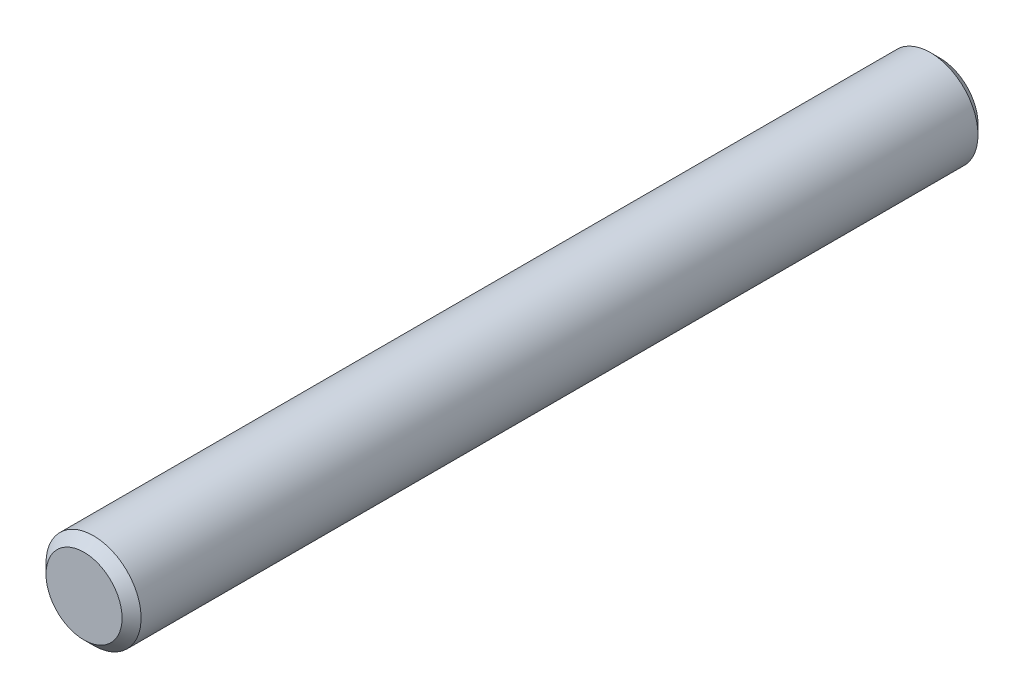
from build123d import *

# Parameters (mm, degrees)
ESQUISSE1_R      = 2.5
EXTRUSION1_DEPTH = 22.5
CHANFREIN1_SIZE  = 0.5


with BuildPart() as part:
    # Esquisse1 → Extrusion1 (new, symmetric)
    with BuildSketch(Plane.XY):
        with Locations(Location((0, 0, 0), (0, 0, 180))):
            Circle(ESQUISSE1_R)
    extrude(amount=EXTRUSION1_DEPTH, both=True)

    # Chanfrein1
    chanfrein1_edges = [part.edges().sort_by_distance(p)[0] for p in [
        (2.5, 0, -22.5),
        (2.5, 0, 22.5),
    ]]
    chamfer(chanfrein1_edges, length=CHANFREIN1_SIZE)


solid = part.part
